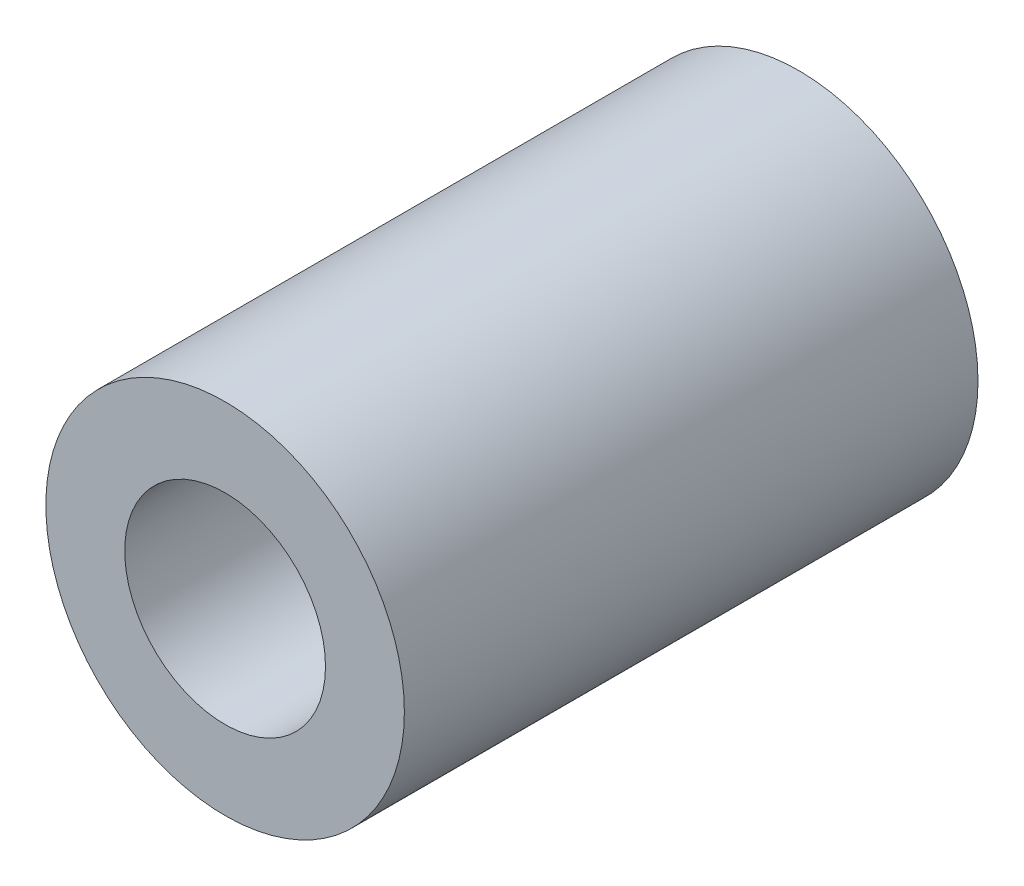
ISO-10303-21;
HEADER;
FILE_DESCRIPTION(('STEP AP214'),'2;1');
FILE_NAME('part.step','',(''),(''),'','','');
FILE_SCHEMA(('AUTOMOTIVE_DESIGN { 1 0 10303 214 1 1 1 1 }'));
ENDSEC;
DATA;
#1=APPLICATION_CONTEXT('core data for automotive mechanical design processes');
#2=APPLICATION_PROTOCOL_DEFINITION('international standard','automotive_design',2000,#1);
#3=PRODUCT_CONTEXT('',#1,'mechanical');
#4=PRODUCT('Part','Part','',(#3));
#5=PRODUCT_RELATED_PRODUCT_CATEGORY('part','',(#4));
#6=PRODUCT_DEFINITION_FORMATION('','',#4);
#7=PRODUCT_DEFINITION_CONTEXT('part definition',#1,'design');
#8=PRODUCT_DEFINITION('design','',#6,#7);
#9=PRODUCT_DEFINITION_SHAPE('','',#8);
#10=(LENGTH_UNIT() NAMED_UNIT(*) SI_UNIT(.MILLI.,.METRE.));
#11=(NAMED_UNIT(*) PLANE_ANGLE_UNIT() SI_UNIT($,.RADIAN.));
#12=(NAMED_UNIT(*) SI_UNIT($,.STERADIAN.) SOLID_ANGLE_UNIT());
#13=UNCERTAINTY_MEASURE_WITH_UNIT(LENGTH_MEASURE(1.E-05),#10,'distance_accuracy_value','');
#14=(GEOMETRIC_REPRESENTATION_CONTEXT(3) GLOBAL_UNCERTAINTY_ASSIGNED_CONTEXT((#13)) GLOBAL_UNIT_ASSIGNED_CONTEXT((#10,
#11,#12)) REPRESENTATION_CONTEXT('',''));
#15=CARTESIAN_POINT('',(0.,0.,0.));
#16=DIRECTION('',(0.,0.,1.));
#17=DIRECTION('',(1.,0.,0.));
#18=AXIS2_PLACEMENT_3D('',#15,#16,#17);
#19=CARTESIAN_POINT('',(7.,0.,7.));
#20=DIRECTION('',(0.,0.,-1.));
#21=DIRECTION('',(-1.,0.,0.));
#22=AXIS2_PLACEMENT_3D('',#19,#20,#21);
#23=PLANE('',#22);
#24=CARTESIAN_POINT('',(0.,0.,7.));
#25=DIRECTION('',(0.,0.,1.));
#26=DIRECTION('',(1.,0.,0.));
#27=AXIS2_PLACEMENT_3D('',#24,#25,#26);
#28=CIRCLE('',#27,4.5);
#29=CARTESIAN_POINT('',(4.5,0.,7.));
#30=VERTEX_POINT('',#29);
#31=EDGE_CURVE('E8',#30,#30,#28,.T.);
#32=ORIENTED_EDGE('',*,*,#31,.F.);
#33=EDGE_LOOP('',(#32));
#34=FACE_BOUND('',#33,.T.);
#35=CARTESIAN_POINT('',(0.,0.,7.));
#36=DIRECTION('',(0.,0.,1.));
#37=DIRECTION('',(1.,0.,0.));
#38=AXIS2_PLACEMENT_3D('',#35,#36,#37);
#39=CIRCLE('',#38,7.);
#40=CARTESIAN_POINT('',(7.,0.,7.));
#41=VERTEX_POINT('',#40);
#42=EDGE_CURVE('E34',#41,#41,#39,.T.);
#43=ORIENTED_EDGE('',*,*,#42,.T.);
#44=EDGE_LOOP('',(#43));
#45=FACE_BOUND('',#44,.T.);
#46=ADVANCED_FACE('F12',(#34,#45),#23,.F.);
#47=CARTESIAN_POINT('',(0.,0.,40.));
#48=DIRECTION('',(0.,0.,1.));
#49=DIRECTION('',(1.,0.,0.));
#50=AXIS2_PLACEMENT_3D('',#47,#48,#49);
#51=CYLINDRICAL_SURFACE('',#50,4.5);
#52=CARTESIAN_POINT('',(0.,0.,0.));
#53=DIRECTION('',(0.,0.,1.));
#54=DIRECTION('',(1.,0.,0.));
#55=AXIS2_PLACEMENT_3D('',#52,#53,#54);
#56=CIRCLE('',#55,4.5);
#57=CARTESIAN_POINT('',(4.5,0.,0.));
#58=VERTEX_POINT('',#57);
#59=EDGE_CURVE('E18',#58,#58,#56,.T.);
#60=ORIENTED_EDGE('',*,*,#59,.F.);
#61=EDGE_LOOP('',(#60));
#62=FACE_BOUND('',#61,.T.);
#63=ORIENTED_EDGE('',*,*,#31,.T.);
#64=EDGE_LOOP('',(#63));
#65=FACE_BOUND('',#64,.T.);
#66=ADVANCED_FACE('F59',(#62,#65),#51,.F.);
#67=CARTESIAN_POINT('',(4.5,0.,0.));
#68=DIRECTION('',(0.,0.,1.));
#69=DIRECTION('',(1.,0.,0.));
#70=AXIS2_PLACEMENT_3D('',#67,#68,#69);
#71=PLANE('',#70);
#72=CARTESIAN_POINT('',(0.,0.,0.));
#73=DIRECTION('',(0.,0.,1.));
#74=DIRECTION('',(1.,0.,0.));
#75=AXIS2_PLACEMENT_3D('',#72,#73,#74);
#76=CIRCLE('',#75,12.5);
#77=CARTESIAN_POINT('',(12.5,0.,0.));
#78=VERTEX_POINT('',#77);
#79=EDGE_CURVE('E22',#78,#78,#76,.T.);
#80=ORIENTED_EDGE('',*,*,#79,.F.);
#81=EDGE_LOOP('',(#80));
#82=FACE_BOUND('',#81,.T.);
#83=ORIENTED_EDGE('',*,*,#59,.T.);
#84=EDGE_LOOP('',(#83));
#85=FACE_BOUND('',#84,.T.);
#86=ADVANCED_FACE('F54',(#82,#85),#71,.F.);
#87=CARTESIAN_POINT('',(0.,0.,40.));
#88=DIRECTION('',(0.,0.,1.));
#89=DIRECTION('',(1.,0.,0.));
#90=AXIS2_PLACEMENT_3D('',#87,#88,#89);
#91=CYLINDRICAL_SURFACE('',#90,12.5);
#92=CARTESIAN_POINT('',(0.,0.,40.));
#93=DIRECTION('',(0.,0.,1.));
#94=DIRECTION('',(1.,0.,0.));
#95=AXIS2_PLACEMENT_3D('',#92,#93,#94);
#96=CIRCLE('',#95,12.5);
#97=CARTESIAN_POINT('',(12.5,0.,40.));
#98=VERTEX_POINT('',#97);
#99=EDGE_CURVE('E26',#98,#98,#96,.T.);
#100=ORIENTED_EDGE('',*,*,#99,.F.);
#101=EDGE_LOOP('',(#100));
#102=FACE_BOUND('',#101,.T.);
#103=ORIENTED_EDGE('',*,*,#79,.T.);
#104=EDGE_LOOP('',(#103));
#105=FACE_BOUND('',#104,.T.);
#106=ADVANCED_FACE('F48',(#102,#105),#91,.T.);
#107=CARTESIAN_POINT('',(12.5,0.,40.));
#108=DIRECTION('',(0.,0.,-1.));
#109=DIRECTION('',(-1.,0.,0.));
#110=AXIS2_PLACEMENT_3D('',#107,#108,#109);
#111=PLANE('',#110);
#112=CARTESIAN_POINT('',(0.,0.,40.));
#113=DIRECTION('',(0.,0.,1.));
#114=DIRECTION('',(1.,0.,0.));
#115=AXIS2_PLACEMENT_3D('',#112,#113,#114);
#116=CIRCLE('',#115,7.);
#117=CARTESIAN_POINT('',(7.,0.,40.));
#118=VERTEX_POINT('',#117);
#119=EDGE_CURVE('E31',#118,#118,#116,.T.);
#120=ORIENTED_EDGE('',*,*,#119,.F.);
#121=EDGE_LOOP('',(#120));
#122=FACE_BOUND('',#121,.T.);
#123=ORIENTED_EDGE('',*,*,#99,.T.);
#124=EDGE_LOOP('',(#123));
#125=FACE_BOUND('',#124,.T.);
#126=ADVANCED_FACE('F42',(#122,#125),#111,.F.);
#127=CARTESIAN_POINT('',(0.,0.,40.));
#128=DIRECTION('',(0.,0.,1.));
#129=DIRECTION('',(1.,0.,0.));
#130=AXIS2_PLACEMENT_3D('',#127,#128,#129);
#131=CYLINDRICAL_SURFACE('',#130,7.);
#132=ORIENTED_EDGE('',*,*,#42,.F.);
#133=EDGE_LOOP('',(#132));
#134=FACE_BOUND('',#133,.T.);
#135=ORIENTED_EDGE('',*,*,#119,.T.);
#136=EDGE_LOOP('',(#135));
#137=FACE_BOUND('',#136,.T.);
#138=ADVANCED_FACE('F39',(#134,#137),#131,.F.);
#139=CLOSED_SHELL('',(#46,#66,#86,#106,#126,#138));
#140=MANIFOLD_SOLID_BREP('B1',#139);
#141=ADVANCED_BREP_SHAPE_REPRESENTATION('',(#18,#140),#14);
#142=SHAPE_DEFINITION_REPRESENTATION(#9,#141);
ENDSEC;
END-ISO-10303-21;
